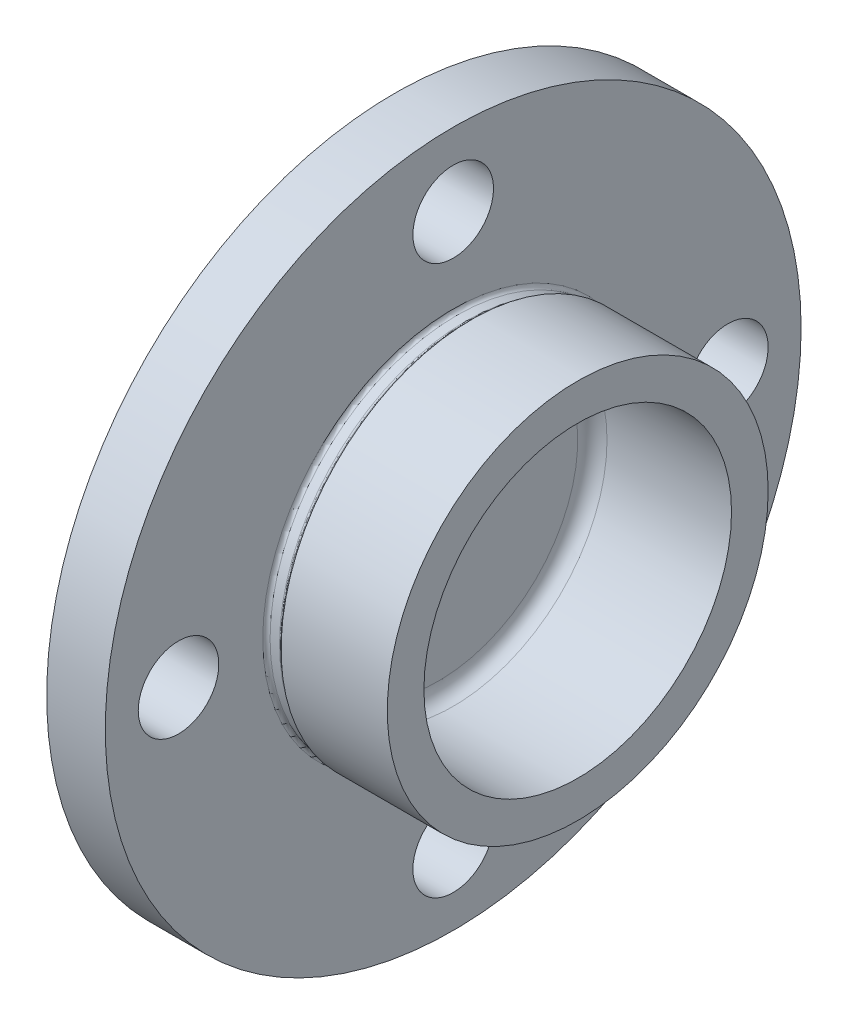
ISO-10303-21;
HEADER;
FILE_DESCRIPTION(('STEP AP214'),'2;1');
FILE_NAME('part.step','',(''),(''),'','','');
FILE_SCHEMA(('AUTOMOTIVE_DESIGN { 1 0 10303 214 1 1 1 1 }'));
ENDSEC;
DATA;
#1=APPLICATION_CONTEXT('core data for automotive mechanical design processes');
#2=APPLICATION_PROTOCOL_DEFINITION('international standard','automotive_design',2000,#1);
#3=PRODUCT_CONTEXT('',#1,'mechanical');
#4=PRODUCT('Part','Part','',(#3));
#5=PRODUCT_RELATED_PRODUCT_CATEGORY('part','',(#4));
#6=PRODUCT_DEFINITION_FORMATION('','',#4);
#7=PRODUCT_DEFINITION_CONTEXT('part definition',#1,'design');
#8=PRODUCT_DEFINITION('design','',#6,#7);
#9=PRODUCT_DEFINITION_SHAPE('','',#8);
#10=(LENGTH_UNIT() NAMED_UNIT(*) SI_UNIT(.MILLI.,.METRE.));
#11=(NAMED_UNIT(*) PLANE_ANGLE_UNIT() SI_UNIT($,.RADIAN.));
#12=(NAMED_UNIT(*) SI_UNIT($,.STERADIAN.) SOLID_ANGLE_UNIT());
#13=UNCERTAINTY_MEASURE_WITH_UNIT(LENGTH_MEASURE(1.E-05),#10,'distance_accuracy_value','');
#14=(GEOMETRIC_REPRESENTATION_CONTEXT(3) GLOBAL_UNCERTAINTY_ASSIGNED_CONTEXT((#13)) GLOBAL_UNIT_ASSIGNED_CONTEXT((#10,
#11,#12)) REPRESENTATION_CONTEXT('',''));
#15=CARTESIAN_POINT('',(0.,0.,0.));
#16=DIRECTION('',(0.,0.,1.));
#17=DIRECTION('',(1.,0.,0.));
#18=AXIS2_PLACEMENT_3D('',#15,#16,#17);
#19=CARTESIAN_POINT('',(6.,-18.142544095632,0.));
#20=DIRECTION('',(-1.,0.,0.));
#21=DIRECTION('',(0.,0.,1.));
#22=AXIS2_PLACEMENT_3D('',#19,#20,#21);
#23=PLANE('',#22);
#24=CARTESIAN_POINT('',(6.,0.,0.));
#25=DIRECTION('',(-1.,0.,0.));
#26=DIRECTION('',(0.,0.,1.));
#27=AXIS2_PLACEMENT_3D('',#24,#25,#26);
#28=CIRCLE('',#27,19.);
#29=CARTESIAN_POINT('',(6.,0.,19.));
#30=VERTEX_POINT('',#29);
#31=EDGE_CURVE('E56',#30,#30,#28,.F.);
#32=ORIENTED_EDGE('',*,*,#31,.T.);
#33=EDGE_LOOP('',(#32));
#34=FACE_BOUND('',#33,.T.);
#35=ADVANCED_FACE('F30',(#34),#23,.F.);
#36=CARTESIAN_POINT('',(29.9069920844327,0.,0.));
#37=DIRECTION('',(1.,0.,0.));
#38=DIRECTION('',(0.,0.,-1.));
#39=AXIS2_PLACEMENT_3D('',#36,#37,#38);
#40=CYLINDRICAL_SURFACE('',#39,21.);
#41=CARTESIAN_POINT('',(8.,0.,0.));
#42=DIRECTION('',(-1.,0.,0.));
#43=DIRECTION('',(0.,0.,1.));
#44=AXIS2_PLACEMENT_3D('',#41,#42,#43);
#45=CIRCLE('',#44,21.);
#46=CARTESIAN_POINT('',(8.,0.,21.));
#47=VERTEX_POINT('',#46);
#48=EDGE_CURVE('E53',#47,#47,#45,.T.);
#49=ORIENTED_EDGE('',*,*,#48,.T.);
#50=EDGE_LOOP('',(#49));
#51=FACE_BOUND('',#50,.T.);
#52=CARTESIAN_POINT('',(25.,0.,0.));
#53=DIRECTION('',(1.,0.,0.));
#54=DIRECTION('',(0.,0.,-1.));
#55=AXIS2_PLACEMENT_3D('',#52,#53,#54);
#56=CIRCLE('',#55,21.);
#57=CARTESIAN_POINT('',(25.,0.,-21.));
#58=VERTEX_POINT('',#57);
#59=EDGE_CURVE('E59',#58,#58,#56,.T.);
#60=ORIENTED_EDGE('',*,*,#59,.T.);
#61=EDGE_LOOP('',(#60));
#62=FACE_BOUND('',#61,.T.);
#63=ADVANCED_FACE('F133',(#51,#62),#40,.F.);
#64=CARTESIAN_POINT('',(25.,-18.142544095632,0.));
#65=DIRECTION('',(-1.,0.,0.));
#66=DIRECTION('',(0.,0.,1.));
#67=AXIS2_PLACEMENT_3D('',#64,#65,#66);
#68=PLANE('',#67);
#69=ORIENTED_EDGE('',*,*,#59,.F.);
#70=EDGE_LOOP('',(#69));
#71=FACE_BOUND('',#70,.T.);
#72=CARTESIAN_POINT('',(25.,0.,0.));
#73=DIRECTION('',(1.,0.,0.));
#74=DIRECTION('',(0.,0.,-1.));
#75=AXIS2_PLACEMENT_3D('',#72,#73,#74);
#76=CIRCLE('',#75,26.);
#77=CARTESIAN_POINT('',(25.,0.,-26.));
#78=VERTEX_POINT('',#77);
#79=EDGE_CURVE('E62',#78,#78,#76,.T.);
#80=ORIENTED_EDGE('',*,*,#79,.T.);
#81=EDGE_LOOP('',(#80));
#82=FACE_BOUND('',#81,.T.);
#83=ADVANCED_FACE('F139',(#71,#82),#68,.F.);
#84=CARTESIAN_POINT('',(29.9069920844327,0.,0.));
#85=DIRECTION('',(1.,0.,0.));
#86=DIRECTION('',(0.,0.,-1.));
#87=AXIS2_PLACEMENT_3D('',#84,#85,#86);
#88=CYLINDRICAL_SURFACE('',#87,26.);
#89=CARTESIAN_POINT('',(10.5,0.,0.));
#90=DIRECTION('',(1.,0.,0.));
#91=DIRECTION('',(0.,0.,-1.));
#92=AXIS2_PLACEMENT_3D('',#89,#90,#91);
#93=CIRCLE('',#92,26.);
#94=CARTESIAN_POINT('',(10.5,0.,-26.));
#95=VERTEX_POINT('',#94);
#96=EDGE_CURVE('E71',#95,#95,#93,.T.);
#97=ORIENTED_EDGE('',*,*,#96,.T.);
#98=EDGE_LOOP('',(#97));
#99=FACE_BOUND('',#98,.T.);
#100=ORIENTED_EDGE('',*,*,#79,.F.);
#101=EDGE_LOOP('',(#100));
#102=FACE_BOUND('',#101,.T.);
#103=ADVANCED_FACE('F164',(#99,#102),#88,.T.);
#104=CARTESIAN_POINT('',(36.050630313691,0.,0.));
#105=DIRECTION('',(1.,0.,0.));
#106=DIRECTION('',(0.,0.,-1.));
#107=AXIS2_PLACEMENT_3D('',#104,#105,#106);
#108=CYLINDRICAL_SURFACE('',#107,25.5);
#109=CARTESIAN_POINT('',(8.5,0.,0.));
#110=DIRECTION('',(-1.,0.,0.));
#111=DIRECTION('',(0.,0.,1.));
#112=AXIS2_PLACEMENT_3D('',#109,#110,#111);
#113=CIRCLE('',#112,25.5);
#114=CARTESIAN_POINT('',(8.5,0.,25.5));
#115=VERTEX_POINT('',#114);
#116=EDGE_CURVE('E45',#115,#115,#113,.F.);
#117=ORIENTED_EDGE('',*,*,#116,.T.);
#118=EDGE_LOOP('',(#117));
#119=FACE_BOUND('',#118,.T.);
#120=CARTESIAN_POINT('',(9.79289321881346,0.,0.));
#121=DIRECTION('',(1.,0.,0.));
#122=DIRECTION('',(0.,0.,-1.));
#123=AXIS2_PLACEMENT_3D('',#120,#121,#122);
#124=CIRCLE('',#123,25.5);
#125=CARTESIAN_POINT('',(9.79289321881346,0.,-25.5));
#126=VERTEX_POINT('',#125);
#127=EDGE_CURVE('E50',#126,#126,#124,.F.);
#128=ORIENTED_EDGE('',*,*,#127,.T.);
#129=EDGE_LOOP('',(#128));
#130=FACE_BOUND('',#129,.T.);
#131=ADVANCED_FACE('F162',(#119,#130),#108,.T.);
#132=CARTESIAN_POINT('',(10.,0.,0.));
#133=DIRECTION('',(1.,0.,0.));
#134=DIRECTION('',(0.,0.,-1.));
#135=AXIS2_PLACEMENT_3D('',#132,#133,#134);
#136=CONICAL_SURFACE('',#135,25.5,0.785398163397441);
#137=CARTESIAN_POINT('',(10.1464466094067,0.,0.));
#138=DIRECTION('',(1.,0.,0.));
#139=DIRECTION('',(0.,0.,-1.));
#140=AXIS2_PLACEMENT_3D('',#137,#138,#139);
#141=CIRCLE('',#140,25.6464466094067);
#142=CARTESIAN_POINT('',(10.1464466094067,0.,-25.6464466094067));
#143=VERTEX_POINT('',#142);
#144=EDGE_CURVE('E37',#143,#143,#141,.T.);
#145=ORIENTED_EDGE('',*,*,#144,.T.);
#146=EDGE_LOOP('',(#145));
#147=FACE_BOUND('',#146,.T.);
#148=ORIENTED_EDGE('',*,*,#96,.F.);
#149=EDGE_LOOP('',(#148));
#150=FACE_BOUND('',#149,.T.);
#151=ADVANCED_FACE('F109',(#147,#150),#136,.T.);
#152=CARTESIAN_POINT('',(0.,-18.142544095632,0.));
#153=DIRECTION('',(1.,0.,0.));
#154=DIRECTION('',(0.,0.,-1.));
#155=AXIS2_PLACEMENT_3D('',#152,#153,#154);
#156=PLANE('',#155);
#157=CARTESIAN_POINT('',(0.,0.,-37.5));
#158=DIRECTION('',(-1.,0.,0.));
#159=DIRECTION('',(0.,0.,1.));
#160=AXIS2_PLACEMENT_3D('',#157,#158,#159);
#161=CIRCLE('',#160,5.5);
#162=CARTESIAN_POINT('',(0.,0.,-32.));
#163=VERTEX_POINT('',#162);
#164=EDGE_CURVE('E98',#163,#163,#161,.T.);
#165=ORIENTED_EDGE('',*,*,#164,.F.);
#166=EDGE_LOOP('',(#165));
#167=FACE_BOUND('',#166,.T.);
#168=CARTESIAN_POINT('',(0.,-37.5,0.));
#169=DIRECTION('',(-1.,0.,0.));
#170=DIRECTION('',(0.,0.,1.));
#171=AXIS2_PLACEMENT_3D('',#168,#169,#170);
#172=CIRCLE('',#171,5.5);
#173=CARTESIAN_POINT('',(0.,-37.5,5.5));
#174=VERTEX_POINT('',#173);
#175=EDGE_CURVE('E92',#174,#174,#172,.T.);
#176=ORIENTED_EDGE('',*,*,#175,.F.);
#177=EDGE_LOOP('',(#176));
#178=FACE_BOUND('',#177,.T.);
#179=CARTESIAN_POINT('',(0.,0.,37.5));
#180=DIRECTION('',(-1.,0.,0.));
#181=DIRECTION('',(0.,0.,1.));
#182=AXIS2_PLACEMENT_3D('',#179,#180,#181);
#183=CIRCLE('',#182,5.5);
#184=CARTESIAN_POINT('',(0.,0.,43.));
#185=VERTEX_POINT('',#184);
#186=EDGE_CURVE('E86',#185,#185,#183,.T.);
#187=ORIENTED_EDGE('',*,*,#186,.F.);
#188=EDGE_LOOP('',(#187));
#189=FACE_BOUND('',#188,.T.);
#190=CARTESIAN_POINT('',(0.,37.5,0.));
#191=DIRECTION('',(-1.,0.,0.));
#192=DIRECTION('',(0.,0.,1.));
#193=AXIS2_PLACEMENT_3D('',#190,#191,#192);
#194=CIRCLE('',#193,5.5);
#195=CARTESIAN_POINT('',(0.,37.5,5.5));
#196=VERTEX_POINT('',#195);
#197=EDGE_CURVE('E80',#196,#196,#194,.T.);
#198=ORIENTED_EDGE('',*,*,#197,.F.);
#199=EDGE_LOOP('',(#198));
#200=FACE_BOUND('',#199,.T.);
#201=CARTESIAN_POINT('',(0.,0.,0.));
#202=DIRECTION('',(1.,0.,0.));
#203=DIRECTION('',(0.,0.,-1.));
#204=AXIS2_PLACEMENT_3D('',#201,#202,#203);
#205=CIRCLE('',#204,27.5);
#206=CARTESIAN_POINT('',(0.,0.,-27.5));
#207=VERTEX_POINT('',#206);
#208=EDGE_CURVE('E74',#207,#207,#205,.T.);
#209=ORIENTED_EDGE('',*,*,#208,.T.);
#210=EDGE_LOOP('',(#209));
#211=FACE_BOUND('',#210,.T.);
#212=CARTESIAN_POINT('',(0.,0.,0.));
#213=DIRECTION('',(1.,0.,0.));
#214=DIRECTION('',(0.,0.,-1.));
#215=AXIS2_PLACEMENT_3D('',#212,#213,#214);
#216=CIRCLE('',#215,47.5);
#217=CARTESIAN_POINT('',(0.,0.,-47.5));
#218=VERTEX_POINT('',#217);
#219=EDGE_CURVE('E68',#218,#218,#216,.T.);
#220=ORIENTED_EDGE('',*,*,#219,.F.);
#221=EDGE_LOOP('',(#220));
#222=FACE_BOUND('',#221,.T.);
#223=ADVANCED_FACE('F105',(#167,#178,#189,#200,#211,#222),#156,.F.);
#224=CARTESIAN_POINT('',(29.9069920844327,0.,0.));
#225=DIRECTION('',(1.,0.,0.));
#226=DIRECTION('',(0.,0.,-1.));
#227=AXIS2_PLACEMENT_3D('',#224,#225,#226);
#228=CYLINDRICAL_SURFACE('',#227,47.5);
#229=CARTESIAN_POINT('',(8.,0.,0.));
#230=DIRECTION('',(1.,0.,0.));
#231=DIRECTION('',(0.,0.,-1.));
#232=AXIS2_PLACEMENT_3D('',#229,#230,#231);
#233=CIRCLE('',#232,47.5);
#234=CARTESIAN_POINT('',(8.,0.,-47.5));
#235=VERTEX_POINT('',#234);
#236=EDGE_CURVE('E65',#235,#235,#233,.T.);
#237=ORIENTED_EDGE('',*,*,#236,.F.);
#238=EDGE_LOOP('',(#237));
#239=FACE_BOUND('',#238,.T.);
#240=ORIENTED_EDGE('',*,*,#219,.T.);
#241=EDGE_LOOP('',(#240));
#242=FACE_BOUND('',#241,.T.);
#243=ADVANCED_FACE('F108',(#239,#242),#228,.T.);
#244=CARTESIAN_POINT('',(8.,-18.142544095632,0.));
#245=DIRECTION('',(-1.,0.,0.));
#246=DIRECTION('',(0.,0.,1.));
#247=AXIS2_PLACEMENT_3D('',#244,#245,#246);
#248=PLANE('',#247);
#249=CARTESIAN_POINT('',(8.,0.,-37.5));
#250=DIRECTION('',(-1.,0.,0.));
#251=DIRECTION('',(0.,0.,1.));
#252=AXIS2_PLACEMENT_3D('',#249,#250,#251);
#253=CIRCLE('',#252,5.5);
#254=CARTESIAN_POINT('',(8.,0.,-32.));
#255=VERTEX_POINT('',#254);
#256=EDGE_CURVE('E95',#255,#255,#253,.F.);
#257=ORIENTED_EDGE('',*,*,#256,.F.);
#258=EDGE_LOOP('',(#257));
#259=FACE_BOUND('',#258,.T.);
#260=CARTESIAN_POINT('',(8.,-37.5,0.));
#261=DIRECTION('',(-1.,0.,0.));
#262=DIRECTION('',(0.,0.,1.));
#263=AXIS2_PLACEMENT_3D('',#260,#261,#262);
#264=CIRCLE('',#263,5.5);
#265=CARTESIAN_POINT('',(8.,-37.5,5.5));
#266=VERTEX_POINT('',#265);
#267=EDGE_CURVE('E89',#266,#266,#264,.F.);
#268=ORIENTED_EDGE('',*,*,#267,.F.);
#269=EDGE_LOOP('',(#268));
#270=FACE_BOUND('',#269,.T.);
#271=CARTESIAN_POINT('',(8.,0.,37.5));
#272=DIRECTION('',(-1.,0.,0.));
#273=DIRECTION('',(0.,0.,1.));
#274=AXIS2_PLACEMENT_3D('',#271,#272,#273);
#275=CIRCLE('',#274,5.5);
#276=CARTESIAN_POINT('',(8.,0.,43.));
#277=VERTEX_POINT('',#276);
#278=EDGE_CURVE('E83',#277,#277,#275,.F.);
#279=ORIENTED_EDGE('',*,*,#278,.F.);
#280=EDGE_LOOP('',(#279));
#281=FACE_BOUND('',#280,.T.);
#282=CARTESIAN_POINT('',(8.,37.5,0.));
#283=DIRECTION('',(-1.,0.,0.));
#284=DIRECTION('',(0.,0.,1.));
#285=AXIS2_PLACEMENT_3D('',#282,#283,#284);
#286=CIRCLE('',#285,5.5);
#287=CARTESIAN_POINT('',(8.,37.5,5.5));
#288=VERTEX_POINT('',#287);
#289=EDGE_CURVE('E77',#288,#288,#286,.F.);
#290=ORIENTED_EDGE('',*,*,#289,.F.);
#291=EDGE_LOOP('',(#290));
#292=FACE_BOUND('',#291,.T.);
#293=CARTESIAN_POINT('',(8.,0.,0.));
#294=DIRECTION('',(-1.,0.,0.));
#295=DIRECTION('',(0.,0.,1.));
#296=AXIS2_PLACEMENT_3D('',#293,#294,#295);
#297=CIRCLE('',#296,26.);
#298=CARTESIAN_POINT('',(8.,0.,26.));
#299=VERTEX_POINT('',#298);
#300=EDGE_CURVE('E41',#299,#299,#297,.T.);
#301=ORIENTED_EDGE('',*,*,#300,.T.);
#302=EDGE_LOOP('',(#301));
#303=FACE_BOUND('',#302,.T.);
#304=ORIENTED_EDGE('',*,*,#236,.T.);
#305=EDGE_LOOP('',(#304));
#306=FACE_BOUND('',#305,.T.);
#307=ADVANCED_FACE('F122',(#259,#270,#281,#292,#303,#306),#248,.F.);
#308=CARTESIAN_POINT('',(1.99999999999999,27.5,0.));
#309=DIRECTION('',(1.,0.,0.));
#310=DIRECTION('',(0.,0.,-1.));
#311=AXIS2_PLACEMENT_3D('',#308,#309,#310);
#312=PLANE('',#311);
#313=CARTESIAN_POINT('',(1.99999999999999,0.,0.));
#314=DIRECTION('',(1.,0.,0.));
#315=DIRECTION('',(0.,0.,-1.));
#316=AXIS2_PLACEMENT_3D('',#313,#314,#315);
#317=CIRCLE('',#316,25.5);
#318=CARTESIAN_POINT('',(1.99999999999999,0.,-25.5));
#319=VERTEX_POINT('',#318);
#320=EDGE_CURVE('E10',#319,#319,#317,.F.);
#321=ORIENTED_EDGE('',*,*,#320,.T.);
#322=EDGE_LOOP('',(#321));
#323=FACE_BOUND('',#322,.T.);
#324=ADVANCED_FACE('F128',(#323),#312,.F.);
#325=CARTESIAN_POINT('',(8.,0.,0.));
#326=DIRECTION('',(-1.,0.,0.));
#327=DIRECTION('',(0.,0.,1.));
#328=AXIS2_PLACEMENT_3D('',#325,#326,#327);
#329=TOROIDAL_SURFACE('',#328,19.,2.);
#330=ORIENTED_EDGE('',*,*,#48,.F.);
#331=EDGE_LOOP('',(#330));
#332=FACE_BOUND('',#331,.T.);
#333=ORIENTED_EDGE('',*,*,#31,.F.);
#334=EDGE_LOOP('',(#333));
#335=FACE_BOUND('',#334,.T.);
#336=ADVANCED_FACE('F144',(#332,#335),#329,.F.);
#337=CARTESIAN_POINT('',(8.5,0.,0.));
#338=DIRECTION('',(-1.,0.,0.));
#339=DIRECTION('',(0.,0.,1.));
#340=AXIS2_PLACEMENT_3D('',#337,#338,#339);
#341=TOROIDAL_SURFACE('',#340,26.,0.5);
#342=ORIENTED_EDGE('',*,*,#300,.F.);
#343=EDGE_LOOP('',(#342));
#344=FACE_BOUND('',#343,.T.);
#345=ORIENTED_EDGE('',*,*,#116,.F.);
#346=EDGE_LOOP('',(#345));
#347=FACE_BOUND('',#346,.T.);
#348=ADVANCED_FACE('F147',(#344,#347),#341,.F.);
#349=CARTESIAN_POINT('',(9.79289321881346,0.,0.));
#350=DIRECTION('',(1.,0.,0.));
#351=DIRECTION('',(0.,0.,-1.));
#352=AXIS2_PLACEMENT_3D('',#349,#350,#351);
#353=TOROIDAL_SURFACE('',#352,26.,0.5);
#354=ORIENTED_EDGE('',*,*,#127,.F.);
#355=EDGE_LOOP('',(#354));
#356=FACE_BOUND('',#355,.T.);
#357=ORIENTED_EDGE('',*,*,#144,.F.);
#358=EDGE_LOOP('',(#357));
#359=FACE_BOUND('',#358,.T.);
#360=ADVANCED_FACE('F150',(#356,#359),#353,.F.);
#361=CARTESIAN_POINT('',(0.,0.,0.));
#362=DIRECTION('',(1.,0.,0.));
#363=DIRECTION('',(0.,0.,-1.));
#364=AXIS2_PLACEMENT_3D('',#361,#362,#363);
#365=TOROIDAL_SURFACE('',#364,25.5,2.);
#366=ORIENTED_EDGE('',*,*,#320,.F.);
#367=EDGE_LOOP('',(#366));
#368=FACE_BOUND('',#367,.T.);
#369=ORIENTED_EDGE('',*,*,#208,.F.);
#370=EDGE_LOOP('',(#369));
#371=FACE_BOUND('',#370,.T.);
#372=ADVANCED_FACE('F32',(#368,#371),#365,.F.);
#373=CARTESIAN_POINT('',(25.001,37.5,0.));
#374=DIRECTION('',(-1.,0.,0.));
#375=DIRECTION('',(0.,0.,1.));
#376=AXIS2_PLACEMENT_3D('',#373,#374,#375);
#377=CYLINDRICAL_SURFACE('',#376,5.5);
#378=ORIENTED_EDGE('',*,*,#197,.T.);
#379=EDGE_LOOP('',(#378));
#380=FACE_BOUND('',#379,.T.);
#381=ORIENTED_EDGE('',*,*,#289,.T.);
#382=EDGE_LOOP('',(#381));
#383=FACE_BOUND('',#382,.T.);
#384=ADVANCED_FACE('F157',(#380,#383),#377,.F.);
#385=CARTESIAN_POINT('',(25.001,0.,37.5));
#386=DIRECTION('',(-1.,0.,0.));
#387=DIRECTION('',(0.,0.,1.));
#388=AXIS2_PLACEMENT_3D('',#385,#386,#387);
#389=CYLINDRICAL_SURFACE('',#388,5.5);
#390=ORIENTED_EDGE('',*,*,#186,.T.);
#391=EDGE_LOOP('',(#390));
#392=FACE_BOUND('',#391,.T.);
#393=ORIENTED_EDGE('',*,*,#278,.T.);
#394=EDGE_LOOP('',(#393));
#395=FACE_BOUND('',#394,.T.);
#396=ADVANCED_FACE('F179',(#392,#395),#389,.F.);
#397=CARTESIAN_POINT('',(25.001,-37.5,0.));
#398=DIRECTION('',(-1.,0.,0.));
#399=DIRECTION('',(0.,0.,1.));
#400=AXIS2_PLACEMENT_3D('',#397,#398,#399);
#401=CYLINDRICAL_SURFACE('',#400,5.5);
#402=ORIENTED_EDGE('',*,*,#175,.T.);
#403=EDGE_LOOP('',(#402));
#404=FACE_BOUND('',#403,.T.);
#405=ORIENTED_EDGE('',*,*,#267,.T.);
#406=EDGE_LOOP('',(#405));
#407=FACE_BOUND('',#406,.T.);
#408=ADVANCED_FACE('F183',(#404,#407),#401,.F.);
#409=CARTESIAN_POINT('',(25.001,0.,-37.5));
#410=DIRECTION('',(-1.,0.,0.));
#411=DIRECTION('',(0.,0.,1.));
#412=AXIS2_PLACEMENT_3D('',#409,#410,#411);
#413=CYLINDRICAL_SURFACE('',#412,5.5);
#414=ORIENTED_EDGE('',*,*,#164,.T.);
#415=EDGE_LOOP('',(#414));
#416=FACE_BOUND('',#415,.T.);
#417=ORIENTED_EDGE('',*,*,#256,.T.);
#418=EDGE_LOOP('',(#417));
#419=FACE_BOUND('',#418,.T.);
#420=ADVANCED_FACE('F102',(#416,#419),#413,.F.);
#421=CLOSED_SHELL('',(#35,#63,#83,#103,#131,#151,#223,#243,#307,#324,#336,#348,#360,#372,#384,
#396,#408,#420));
#422=MANIFOLD_SOLID_BREP('B2',#421);
#423=ADVANCED_BREP_SHAPE_REPRESENTATION('',(#18,#422),#14);
#424=SHAPE_DEFINITION_REPRESENTATION(#9,#423);
ENDSEC;
END-ISO-10303-21;
